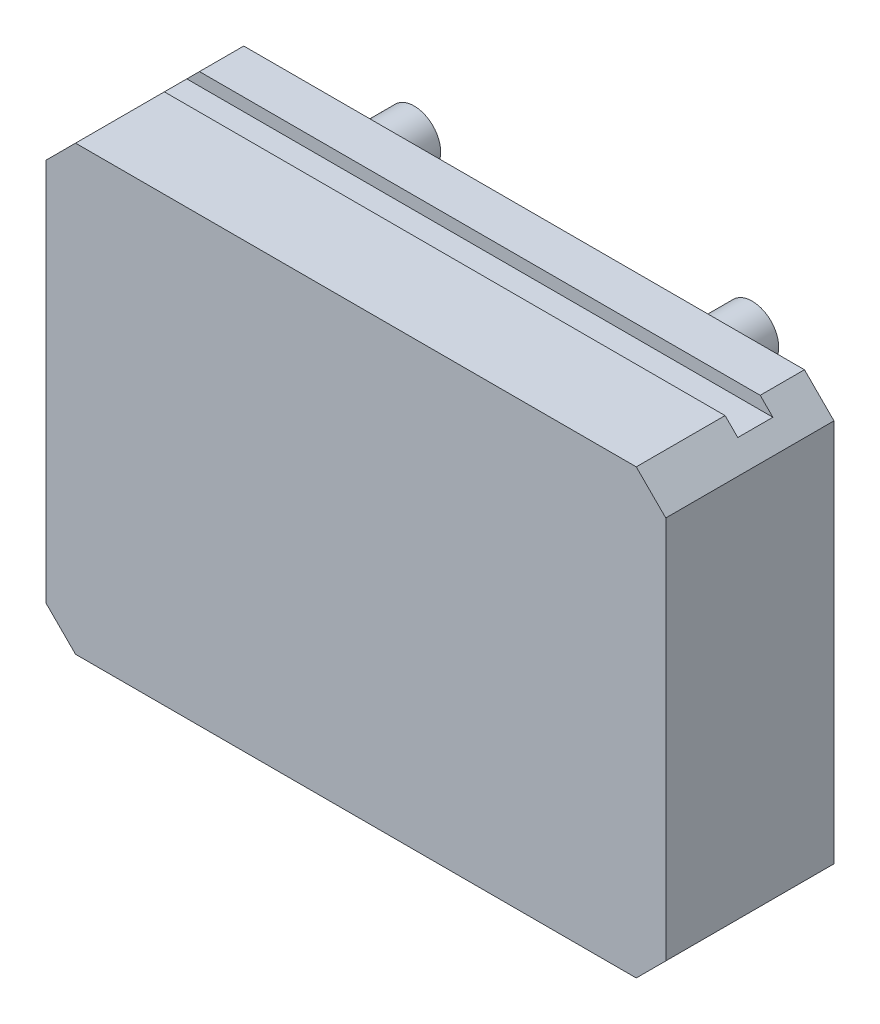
ISO-10303-21;
HEADER;
FILE_DESCRIPTION(('STEP AP214'),'2;1');
FILE_NAME('part.step','',(''),(''),'','','');
FILE_SCHEMA(('AUTOMOTIVE_DESIGN { 1 0 10303 214 1 1 1 1 }'));
ENDSEC;
DATA;
#1=APPLICATION_CONTEXT('core data for automotive mechanical design processes');
#2=APPLICATION_PROTOCOL_DEFINITION('international standard','automotive_design',2000,#1);
#3=PRODUCT_CONTEXT('',#1,'mechanical');
#4=PRODUCT('Part','Part','',(#3));
#5=PRODUCT_RELATED_PRODUCT_CATEGORY('part','',(#4));
#6=PRODUCT_DEFINITION_FORMATION('','',#4);
#7=PRODUCT_DEFINITION_CONTEXT('part definition',#1,'design');
#8=PRODUCT_DEFINITION('design','',#6,#7);
#9=PRODUCT_DEFINITION_SHAPE('','',#8);
#10=(LENGTH_UNIT() NAMED_UNIT(*) SI_UNIT(.MILLI.,.METRE.));
#11=(NAMED_UNIT(*) PLANE_ANGLE_UNIT() SI_UNIT($,.RADIAN.));
#12=(NAMED_UNIT(*) SI_UNIT($,.STERADIAN.) SOLID_ANGLE_UNIT());
#13=UNCERTAINTY_MEASURE_WITH_UNIT(LENGTH_MEASURE(1.E-05),#10,'distance_accuracy_value','');
#14=(GEOMETRIC_REPRESENTATION_CONTEXT(3) GLOBAL_UNCERTAINTY_ASSIGNED_CONTEXT((#13)) GLOBAL_UNIT_ASSIGNED_CONTEXT((#10,
#11,#12)) REPRESENTATION_CONTEXT('',''));
#15=CARTESIAN_POINT('',(0.,0.,0.));
#16=DIRECTION('',(0.,0.,1.));
#17=DIRECTION('',(1.,0.,0.));
#18=AXIS2_PLACEMENT_3D('',#15,#16,#17);
#19=CARTESIAN_POINT('',(-105.,-75.,57.));
#20=DIRECTION('',(1.,0.,0.));
#21=DIRECTION('',(0.,0.,-1.));
#22=AXIS2_PLACEMENT_3D('',#19,#20,#21);
#23=PLANE('',#22);
#24=DIRECTION('',(0.,-1.,0.));
#25=VECTOR('',#24,1.);
#26=CARTESIAN_POINT('',(-105.,-75.,57.));
#27=LINE('',#26,#25);
#28=CARTESIAN_POINT('',(-105.,64.9999999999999,57.));
#29=VERTEX_POINT('',#28);
#30=CARTESIAN_POINT('',(-105.,-64.9999999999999,57.));
#31=VERTEX_POINT('',#30);
#32=EDGE_CURVE('E264',#29,#31,#27,.T.);
#33=ORIENTED_EDGE('',*,*,#32,.F.);
#34=DIRECTION('',(0.,0.,-1.));
#35=VECTOR('',#34,1.);
#36=CARTESIAN_POINT('',(-105.,65.,57.));
#37=LINE('',#36,#35);
#38=CARTESIAN_POINT('',(-105.,64.9999999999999,0.));
#39=VERTEX_POINT('',#38);
#40=EDGE_CURVE('E206',#29,#39,#37,.T.);
#41=ORIENTED_EDGE('',*,*,#40,.T.);
#42=DIRECTION('',(0.,-1.,0.));
#43=VECTOR('',#42,1.);
#44=CARTESIAN_POINT('',(-105.,-75.,0.));
#45=LINE('',#44,#43);
#46=CARTESIAN_POINT('',(-105.,-64.9999999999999,0.));
#47=VERTEX_POINT('',#46);
#48=EDGE_CURVE('E274',#39,#47,#45,.T.);
#49=ORIENTED_EDGE('',*,*,#48,.T.);
#50=DIRECTION('',(0.,0.,1.));
#51=VECTOR('',#50,1.);
#52=CARTESIAN_POINT('',(-105.,-64.9999999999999,57.));
#53=LINE('',#52,#51);
#54=EDGE_CURVE('E204',#47,#31,#53,.T.);
#55=ORIENTED_EDGE('',*,*,#54,.T.);
#56=EDGE_LOOP('',(#33,#41,#49,#55));
#57=FACE_BOUND('',#56,.T.);
#58=CARTESIAN_POINT('',(-105.,0.,38.2));
#59=DIRECTION('',(1.,0.,0.));
#60=DIRECTION('',(0.,0.,-1.));
#61=AXIS2_PLACEMENT_3D('',#58,#59,#60);
#62=CIRCLE('',#61,7.5);
#63=CARTESIAN_POINT('',(-105.,0.,30.7));
#64=VERTEX_POINT('',#63);
#65=EDGE_CURVE('E11',#64,#64,#62,.F.);
#66=ORIENTED_EDGE('',*,*,#65,.F.);
#67=EDGE_LOOP('',(#66));
#68=FACE_BOUND('',#67,.T.);
#69=ADVANCED_FACE('F36',(#57,#68),#23,.F.);
#70=CARTESIAN_POINT('',(-105.,75.,57.));
#71=DIRECTION('',(0.,-1.,0.));
#72=DIRECTION('',(0.,0.,-1.));
#73=AXIS2_PLACEMENT_3D('',#70,#71,#72);
#74=PLANE('',#73);
#75=DIRECTION('',(1.,0.,0.));
#76=VECTOR('',#75,1.);
#77=CARTESIAN_POINT('',(-105.,75.,15.));
#78=LINE('',#77,#76);
#79=CARTESIAN_POINT('',(-95.,75.,15.));
#80=VERTEX_POINT('',#79);
#81=CARTESIAN_POINT('',(95.,75.,15.));
#82=VERTEX_POINT('',#81);
#83=EDGE_CURVE('E159',#80,#82,#78,.T.);
#84=ORIENTED_EDGE('',*,*,#83,.T.);
#85=DIRECTION('',(0.,0.,-1.));
#86=VECTOR('',#85,1.);
#87=CARTESIAN_POINT('',(95.,75.,57.));
#88=LINE('',#87,#86);
#89=CARTESIAN_POINT('',(95.,75.,0.));
#90=VERTEX_POINT('',#89);
#91=EDGE_CURVE('E178',#82,#90,#88,.T.);
#92=ORIENTED_EDGE('',*,*,#91,.T.);
#93=DIRECTION('',(-1.,0.,0.));
#94=VECTOR('',#93,1.);
#95=CARTESIAN_POINT('',(-105.,75.,0.));
#96=LINE('',#95,#94);
#97=CARTESIAN_POINT('',(-94.9999999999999,75.,0.));
#98=VERTEX_POINT('',#97);
#99=EDGE_CURVE('E256',#90,#98,#96,.T.);
#100=ORIENTED_EDGE('',*,*,#99,.T.);
#101=DIRECTION('',(0.,0.,1.));
#102=VECTOR('',#101,1.);
#103=CARTESIAN_POINT('',(-94.9999999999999,75.,57.));
#104=LINE('',#103,#102);
#105=EDGE_CURVE('E182',#98,#80,#104,.T.);
#106=ORIENTED_EDGE('',*,*,#105,.T.);
#107=EDGE_LOOP('',(#84,#92,#100,#106));
#108=FACE_BOUND('',#107,.T.);
#109=ADVANCED_FACE('F354',(#108),#74,.F.);
#110=DIRECTION('',(-1.,0.,0.));
#111=VECTOR('',#110,1.);
#112=CARTESIAN_POINT('',(-105.,75.,26.9));
#113=LINE('',#112,#111);
#114=CARTESIAN_POINT('',(95.,75.,26.9));
#115=VERTEX_POINT('',#114);
#116=CARTESIAN_POINT('',(-95.,75.,26.9));
#117=VERTEX_POINT('',#116);
#118=EDGE_CURVE('E148',#115,#117,#113,.T.);
#119=ORIENTED_EDGE('',*,*,#118,.T.);
#120=CARTESIAN_POINT('',(-94.9999999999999,75.,57.));
#121=VERTEX_POINT('',#120);
#122=EDGE_CURVE('E279',#117,#121,#104,.T.);
#123=ORIENTED_EDGE('',*,*,#122,.T.);
#124=DIRECTION('',(-1.,0.,0.));
#125=VECTOR('',#124,1.);
#126=CARTESIAN_POINT('',(-105.,75.,57.));
#127=LINE('',#126,#125);
#128=CARTESIAN_POINT('',(95.,75.,57.));
#129=VERTEX_POINT('',#128);
#130=EDGE_CURVE('E176',#129,#121,#127,.T.);
#131=ORIENTED_EDGE('',*,*,#130,.F.);
#132=EDGE_CURVE('E168',#129,#115,#88,.T.);
#133=ORIENTED_EDGE('',*,*,#132,.T.);
#134=EDGE_LOOP('',(#119,#123,#131,#133));
#135=FACE_BOUND('',#134,.T.);
#136=ADVANCED_FACE('F174',(#135),#74,.F.);
#137=CARTESIAN_POINT('',(95.,75.,57.));
#138=DIRECTION('',(-0.70710678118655,-0.707106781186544,0.));
#139=DIRECTION('',(0.707106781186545,-0.70710678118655,0.));
#140=AXIS2_PLACEMENT_3D('',#137,#138,#139);
#141=PLANE('',#140);
#142=ORIENTED_EDGE('',*,*,#91,.F.);
#143=DIRECTION('',(-0.707106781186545,0.707106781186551,0.));
#144=VECTOR('',#143,1.);
#145=CARTESIAN_POINT('',(95.,75.,15.));
#146=LINE('',#145,#144);
#147=CARTESIAN_POINT('',(99.3,70.7,15.));
#148=VERTEX_POINT('',#147);
#149=EDGE_CURVE('E171',#82,#148,#146,.F.);
#150=ORIENTED_EDGE('',*,*,#149,.T.);
#151=DIRECTION('',(0.,0.,1.));
#152=VECTOR('',#151,1.);
#153=CARTESIAN_POINT('',(99.3,70.7,57.));
#154=LINE('',#153,#152);
#155=CARTESIAN_POINT('',(99.3,70.7,26.9));
#156=VERTEX_POINT('',#155);
#157=EDGE_CURVE('E170',#156,#148,#154,.F.);
#158=ORIENTED_EDGE('',*,*,#157,.F.);
#159=DIRECTION('',(0.707106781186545,-0.707106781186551,0.));
#160=VECTOR('',#159,1.);
#161=CARTESIAN_POINT('',(95.,75.,26.9));
#162=LINE('',#161,#160);
#163=EDGE_CURVE('E152',#156,#115,#162,.F.);
#164=ORIENTED_EDGE('',*,*,#163,.T.);
#165=ORIENTED_EDGE('',*,*,#132,.F.);
#166=DIRECTION('',(0.707106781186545,-0.70710678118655,0.));
#167=VECTOR('',#166,1.);
#168=CARTESIAN_POINT('',(95.,75.,57.));
#169=LINE('',#168,#167);
#170=CARTESIAN_POINT('',(105.,64.9999999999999,57.));
#171=VERTEX_POINT('',#170);
#172=EDGE_CURVE('E202',#171,#129,#169,.F.);
#173=ORIENTED_EDGE('',*,*,#172,.F.);
#174=DIRECTION('',(0.,0.,1.));
#175=VECTOR('',#174,1.);
#176=CARTESIAN_POINT('',(105.,64.9999999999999,57.));
#177=LINE('',#176,#175);
#178=CARTESIAN_POINT('',(105.,64.9999999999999,0.));
#179=VERTEX_POINT('',#178);
#180=EDGE_CURVE('E194',#179,#171,#177,.T.);
#181=ORIENTED_EDGE('',*,*,#180,.F.);
#182=DIRECTION('',(-0.707106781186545,0.70710678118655,0.));
#183=VECTOR('',#182,1.);
#184=CARTESIAN_POINT('',(-4.99999999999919,175.,0.));
#185=LINE('',#184,#183);
#186=EDGE_CURVE('E189',#90,#179,#185,.F.);
#187=ORIENTED_EDGE('',*,*,#186,.F.);
#188=EDGE_LOOP('',(#142,#150,#158,#164,#165,#173,#181,#187));
#189=FACE_BOUND('',#188,.T.);
#190=ADVANCED_FACE('F166',(#189),#141,.F.);
#191=CARTESIAN_POINT('',(-105.,65.,57.));
#192=DIRECTION('',(0.707106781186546,-0.707106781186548,0.));
#193=DIRECTION('',(0.707106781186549,0.707106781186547,0.));
#194=AXIS2_PLACEMENT_3D('',#191,#192,#193);
#195=PLANE('',#194);
#196=DIRECTION('',(0.,0.,-1.));
#197=VECTOR('',#196,1.);
#198=CARTESIAN_POINT('',(-99.3,70.7,57.));
#199=LINE('',#198,#197);
#200=CARTESIAN_POINT('',(-99.3,70.7,15.));
#201=VERTEX_POINT('',#200);
#202=CARTESIAN_POINT('',(-99.3,70.7,26.9));
#203=VERTEX_POINT('',#202);
#204=EDGE_CURVE('E223',#201,#203,#199,.F.);
#205=ORIENTED_EDGE('',*,*,#204,.F.);
#206=DIRECTION('',(-0.707106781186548,-0.707106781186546,0.));
#207=VECTOR('',#206,1.);
#208=CARTESIAN_POINT('',(-105.,65.,15.));
#209=LINE('',#208,#207);
#210=EDGE_CURVE('E226',#201,#80,#209,.F.);
#211=ORIENTED_EDGE('',*,*,#210,.T.);
#212=ORIENTED_EDGE('',*,*,#105,.F.);
#213=DIRECTION('',(-0.707106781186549,-0.707106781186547,0.));
#214=VECTOR('',#213,1.);
#215=CARTESIAN_POINT('',(-100.,70.,0.));
#216=LINE('',#215,#214);
#217=EDGE_CURVE('E187',#39,#98,#216,.F.);
#218=ORIENTED_EDGE('',*,*,#217,.F.);
#219=ORIENTED_EDGE('',*,*,#40,.F.);
#220=DIRECTION('',(0.707106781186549,0.707106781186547,0.));
#221=VECTOR('',#220,1.);
#222=CARTESIAN_POINT('',(-105.,65.,57.));
#223=LINE('',#222,#221);
#224=EDGE_CURVE('E200',#121,#29,#223,.F.);
#225=ORIENTED_EDGE('',*,*,#224,.F.);
#226=ORIENTED_EDGE('',*,*,#122,.F.);
#227=DIRECTION('',(0.707106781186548,0.707106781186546,0.));
#228=VECTOR('',#227,1.);
#229=CARTESIAN_POINT('',(-105.,65.,26.9));
#230=LINE('',#229,#228);
#231=EDGE_CURVE('E155',#117,#203,#230,.F.);
#232=ORIENTED_EDGE('',*,*,#231,.T.);
#233=EDGE_LOOP('',(#205,#211,#212,#218,#219,#225,#226,#232));
#234=FACE_BOUND('',#233,.T.);
#235=ADVANCED_FACE('F368',(#234),#195,.F.);
#236=CARTESIAN_POINT('',(-105.,-75.,57.));
#237=DIRECTION('',(0.,1.,0.));
#238=DIRECTION('',(0.,0.,1.));
#239=AXIS2_PLACEMENT_3D('',#236,#237,#238);
#240=PLANE('',#239);
#241=DIRECTION('',(0.,0.,-1.));
#242=VECTOR('',#241,1.);
#243=CARTESIAN_POINT('',(-95.,-75.,57.));
#244=LINE('',#243,#242);
#245=CARTESIAN_POINT('',(-95.,-75.,57.));
#246=VERTEX_POINT('',#245);
#247=CARTESIAN_POINT('',(-95.,-75.,26.9));
#248=VERTEX_POINT('',#247);
#249=EDGE_CURVE('E210',#246,#248,#244,.T.);
#250=ORIENTED_EDGE('',*,*,#249,.T.);
#251=DIRECTION('',(-1.,0.,0.));
#252=VECTOR('',#251,1.);
#253=CARTESIAN_POINT('',(-105.,-75.,26.9));
#254=LINE('',#253,#252);
#255=CARTESIAN_POINT('',(94.9999999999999,-75.,26.9));
#256=VERTEX_POINT('',#255);
#257=EDGE_CURVE('E290',#256,#248,#254,.T.);
#258=ORIENTED_EDGE('',*,*,#257,.F.);
#259=DIRECTION('',(0.,0.,1.));
#260=VECTOR('',#259,1.);
#261=CARTESIAN_POINT('',(94.9999999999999,-75.,57.));
#262=LINE('',#261,#260);
#263=CARTESIAN_POINT('',(95.,-75.,57.));
#264=VERTEX_POINT('',#263);
#265=EDGE_CURVE('E213',#256,#264,#262,.T.);
#266=ORIENTED_EDGE('',*,*,#265,.T.);
#267=DIRECTION('',(1.,0.,0.));
#268=VECTOR('',#267,1.);
#269=CARTESIAN_POINT('',(-105.,-75.,57.));
#270=LINE('',#269,#268);
#271=EDGE_CURVE('E267',#246,#264,#270,.T.);
#272=ORIENTED_EDGE('',*,*,#271,.F.);
#273=EDGE_LOOP('',(#250,#258,#266,#272));
#274=FACE_BOUND('',#273,.T.);
#275=ADVANCED_FACE('F370',(#274),#240,.F.);
#276=CARTESIAN_POINT('',(94.9999999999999,-75.,0.));
#277=VERTEX_POINT('',#276);
#278=CARTESIAN_POINT('',(94.9999999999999,-75.,15.));
#279=VERTEX_POINT('',#278);
#280=EDGE_CURVE('E214',#277,#279,#262,.T.);
#281=ORIENTED_EDGE('',*,*,#280,.T.);
#282=DIRECTION('',(1.,0.,0.));
#283=VECTOR('',#282,1.);
#284=CARTESIAN_POINT('',(-105.,-75.,15.));
#285=LINE('',#284,#283);
#286=CARTESIAN_POINT('',(-95.,-75.,15.));
#287=VERTEX_POINT('',#286);
#288=EDGE_CURVE('E293',#287,#279,#285,.T.);
#289=ORIENTED_EDGE('',*,*,#288,.F.);
#290=CARTESIAN_POINT('',(-95.,-75.,0.));
#291=VERTEX_POINT('',#290);
#292=EDGE_CURVE('E209',#287,#291,#244,.T.);
#293=ORIENTED_EDGE('',*,*,#292,.T.);
#294=DIRECTION('',(1.,0.,0.));
#295=VECTOR('',#294,1.);
#296=CARTESIAN_POINT('',(-105.,-75.,0.));
#297=LINE('',#296,#295);
#298=EDGE_CURVE('E269',#291,#277,#297,.T.);
#299=ORIENTED_EDGE('',*,*,#298,.T.);
#300=EDGE_LOOP('',(#281,#289,#293,#299));
#301=FACE_BOUND('',#300,.T.);
#302=ADVANCED_FACE('F364',(#301),#240,.F.);
#303=CARTESIAN_POINT('',(105.,-75.,57.));
#304=DIRECTION('',(-1.,0.,0.));
#305=DIRECTION('',(0.,0.,1.));
#306=AXIS2_PLACEMENT_3D('',#303,#304,#305);
#307=PLANE('',#306);
#308=DIRECTION('',(0.,1.,0.));
#309=VECTOR('',#308,1.);
#310=CARTESIAN_POINT('',(105.,-75.,0.));
#311=LINE('',#310,#309);
#312=CARTESIAN_POINT('',(105.,-65.,0.));
#313=VERTEX_POINT('',#312);
#314=EDGE_CURVE('E265',#313,#179,#311,.T.);
#315=ORIENTED_EDGE('',*,*,#314,.T.);
#316=ORIENTED_EDGE('',*,*,#180,.T.);
#317=DIRECTION('',(0.,1.,0.));
#318=VECTOR('',#317,1.);
#319=CARTESIAN_POINT('',(105.,-75.,57.));
#320=LINE('',#319,#318);
#321=CARTESIAN_POINT('',(105.,-65.,57.));
#322=VERTEX_POINT('',#321);
#323=EDGE_CURVE('E280',#322,#171,#320,.T.);
#324=ORIENTED_EDGE('',*,*,#323,.F.);
#325=DIRECTION('',(0.,0.,-1.));
#326=VECTOR('',#325,1.);
#327=CARTESIAN_POINT('',(105.,-65.,57.));
#328=LINE('',#327,#326);
#329=EDGE_CURVE('E191',#322,#313,#328,.T.);
#330=ORIENTED_EDGE('',*,*,#329,.T.);
#331=EDGE_LOOP('',(#315,#316,#324,#330));
#332=FACE_BOUND('',#331,.T.);
#333=ADVANCED_FACE('F407',(#332),#307,.F.);
#334=CARTESIAN_POINT('',(-105.,75.,57.));
#335=DIRECTION('',(0.,0.,-1.));
#336=DIRECTION('',(-1.,0.,0.));
#337=AXIS2_PLACEMENT_3D('',#334,#335,#336);
#338=PLANE('',#337);
#339=ORIENTED_EDGE('',*,*,#323,.T.);
#340=ORIENTED_EDGE('',*,*,#172,.T.);
#341=ORIENTED_EDGE('',*,*,#130,.T.);
#342=ORIENTED_EDGE('',*,*,#224,.T.);
#343=ORIENTED_EDGE('',*,*,#32,.T.);
#344=DIRECTION('',(-0.707106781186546,0.707106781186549,0.));
#345=VECTOR('',#344,1.);
#346=CARTESIAN_POINT('',(-95.,-75.,57.));
#347=LINE('',#346,#345);
#348=EDGE_CURVE('E196',#31,#246,#347,.F.);
#349=ORIENTED_EDGE('',*,*,#348,.T.);
#350=ORIENTED_EDGE('',*,*,#271,.T.);
#351=DIRECTION('',(-0.707106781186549,-0.707106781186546,0.));
#352=VECTOR('',#351,1.);
#353=CARTESIAN_POINT('',(105.,-65.,57.));
#354=LINE('',#353,#352);
#355=EDGE_CURVE('E198',#264,#322,#354,.F.);
#356=ORIENTED_EDGE('',*,*,#355,.T.);
#357=EDGE_LOOP('',(#339,#340,#341,#342,#343,#349,#350,#356));
#358=FACE_BOUND('',#357,.T.);
#359=ADVANCED_FACE('F246',(#358),#338,.F.);
#360=CARTESIAN_POINT('',(-105.,75.,0.));
#361=DIRECTION('',(0.,0.,-1.));
#362=DIRECTION('',(-1.,0.,0.));
#363=AXIS2_PLACEMENT_3D('',#360,#361,#362);
#364=PLANE('',#363);
#365=CARTESIAN_POINT('',(57.2756492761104,57.2756492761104,0.));
#366=DIRECTION('',(0.,0.,-1.));
#367=DIRECTION('',(-1.,0.,0.));
#368=AXIS2_PLACEMENT_3D('',#365,#366,#367);
#369=CIRCLE('',#368,9.99999999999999);
#370=CARTESIAN_POINT('',(47.2756492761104,57.2756492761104,0.));
#371=VERTEX_POINT('',#370);
#372=EDGE_CURVE('E44',#371,#371,#369,.T.);
#373=ORIENTED_EDGE('',*,*,#372,.F.);
#374=EDGE_LOOP('',(#373));
#375=FACE_BOUND('',#374,.T.);
#376=CARTESIAN_POINT('',(-57.2756492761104,57.2756492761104,0.));
#377=DIRECTION('',(0.,0.,-1.));
#378=DIRECTION('',(-1.,0.,0.));
#379=AXIS2_PLACEMENT_3D('',#376,#377,#378);
#380=CIRCLE('',#379,9.99999999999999);
#381=CARTESIAN_POINT('',(-67.2756492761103,57.2756492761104,0.));
#382=VERTEX_POINT('',#381);
#383=EDGE_CURVE('E235',#382,#382,#380,.T.);
#384=ORIENTED_EDGE('',*,*,#383,.F.);
#385=EDGE_LOOP('',(#384));
#386=FACE_BOUND('',#385,.T.);
#387=CARTESIAN_POINT('',(-57.2756492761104,-57.2756492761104,0.));
#388=DIRECTION('',(0.,0.,-1.));
#389=DIRECTION('',(-1.,0.,0.));
#390=AXIS2_PLACEMENT_3D('',#387,#388,#389);
#391=CIRCLE('',#390,9.99999999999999);
#392=CARTESIAN_POINT('',(-67.2756492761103,-57.2756492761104,0.));
#393=VERTEX_POINT('',#392);
#394=EDGE_CURVE('E232',#393,#393,#391,.T.);
#395=ORIENTED_EDGE('',*,*,#394,.F.);
#396=EDGE_LOOP('',(#395));
#397=FACE_BOUND('',#396,.T.);
#398=CARTESIAN_POINT('',(57.2756492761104,-57.2756492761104,0.));
#399=DIRECTION('',(0.,0.,-1.));
#400=DIRECTION('',(-1.,0.,0.));
#401=AXIS2_PLACEMENT_3D('',#398,#399,#400);
#402=CIRCLE('',#401,9.99999999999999);
#403=CARTESIAN_POINT('',(47.2756492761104,-57.2756492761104,0.));
#404=VERTEX_POINT('',#403);
#405=EDGE_CURVE('E229',#404,#404,#402,.T.);
#406=ORIENTED_EDGE('',*,*,#405,.F.);
#407=EDGE_LOOP('',(#406));
#408=FACE_BOUND('',#407,.T.);
#409=ORIENTED_EDGE('',*,*,#99,.F.);
#410=ORIENTED_EDGE('',*,*,#186,.T.);
#411=ORIENTED_EDGE('',*,*,#314,.F.);
#412=DIRECTION('',(0.707106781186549,0.707106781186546,0.));
#413=VECTOR('',#412,1.);
#414=CARTESIAN_POINT('',(69.9999999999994,-100.,0.));
#415=LINE('',#414,#413);
#416=EDGE_CURVE('E180',#313,#277,#415,.F.);
#417=ORIENTED_EDGE('',*,*,#416,.T.);
#418=ORIENTED_EDGE('',*,*,#298,.F.);
#419=DIRECTION('',(0.707106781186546,-0.707106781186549,0.));
#420=VECTOR('',#419,1.);
#421=CARTESIAN_POINT('',(-175.,5.00000000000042,0.));
#422=LINE('',#421,#420);
#423=EDGE_CURVE('E177',#291,#47,#422,.F.);
#424=ORIENTED_EDGE('',*,*,#423,.T.);
#425=ORIENTED_EDGE('',*,*,#48,.F.);
#426=ORIENTED_EDGE('',*,*,#217,.T.);
#427=EDGE_LOOP('',(#409,#410,#411,#417,#418,#424,#425,#426));
#428=FACE_BOUND('',#427,.T.);
#429=ADVANCED_FACE('F242',(#375,#386,#397,#408,#428),#364,.T.);
#430=CARTESIAN_POINT('',(105.,-65.,57.));
#431=DIRECTION('',(-0.707106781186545,0.707106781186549,0.));
#432=DIRECTION('',(-0.707106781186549,-0.707106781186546,0.));
#433=AXIS2_PLACEMENT_3D('',#430,#431,#432);
#434=PLANE('',#433);
#435=DIRECTION('',(0.70710678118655,0.707106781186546,0.));
#436=VECTOR('',#435,1.);
#437=CARTESIAN_POINT('',(105.,-65.,26.9));
#438=LINE('',#437,#436);
#439=CARTESIAN_POINT('',(99.3,-70.7,26.9));
#440=VERTEX_POINT('',#439);
#441=EDGE_CURVE('E277',#440,#256,#438,.F.);
#442=ORIENTED_EDGE('',*,*,#441,.F.);
#443=DIRECTION('',(0.,0.,-1.));
#444=VECTOR('',#443,1.);
#445=CARTESIAN_POINT('',(99.2999999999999,-70.7,57.));
#446=LINE('',#445,#444);
#447=CARTESIAN_POINT('',(99.3,-70.7,15.));
#448=VERTEX_POINT('',#447);
#449=EDGE_CURVE('E288',#448,#440,#446,.F.);
#450=ORIENTED_EDGE('',*,*,#449,.F.);
#451=DIRECTION('',(-0.70710678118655,-0.707106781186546,0.));
#452=VECTOR('',#451,1.);
#453=CARTESIAN_POINT('',(105.,-65.,15.));
#454=LINE('',#453,#452);
#455=EDGE_CURVE('E286',#279,#448,#454,.F.);
#456=ORIENTED_EDGE('',*,*,#455,.F.);
#457=ORIENTED_EDGE('',*,*,#280,.F.);
#458=ORIENTED_EDGE('',*,*,#416,.F.);
#459=ORIENTED_EDGE('',*,*,#329,.F.);
#460=ORIENTED_EDGE('',*,*,#355,.F.);
#461=ORIENTED_EDGE('',*,*,#265,.F.);
#462=EDGE_LOOP('',(#442,#450,#456,#457,#458,#459,#460,#461));
#463=FACE_BOUND('',#462,.T.);
#464=ADVANCED_FACE('F245',(#463),#434,.F.);
#465=CARTESIAN_POINT('',(-95.,-75.,57.));
#466=DIRECTION('',(0.707106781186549,0.707106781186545,0.));
#467=DIRECTION('',(-0.707106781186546,0.707106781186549,0.));
#468=AXIS2_PLACEMENT_3D('',#465,#466,#467);
#469=PLANE('',#468);
#470=DIRECTION('',(0.707106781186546,-0.70710678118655,0.));
#471=VECTOR('',#470,1.);
#472=CARTESIAN_POINT('',(-95.,-75.,26.9));
#473=LINE('',#472,#471);
#474=CARTESIAN_POINT('',(-99.3,-70.7,26.9));
#475=VERTEX_POINT('',#474);
#476=EDGE_CURVE('E221',#248,#475,#473,.F.);
#477=ORIENTED_EDGE('',*,*,#476,.F.);
#478=ORIENTED_EDGE('',*,*,#249,.F.);
#479=ORIENTED_EDGE('',*,*,#348,.F.);
#480=ORIENTED_EDGE('',*,*,#54,.F.);
#481=ORIENTED_EDGE('',*,*,#423,.F.);
#482=ORIENTED_EDGE('',*,*,#292,.F.);
#483=DIRECTION('',(-0.707106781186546,0.70710678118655,0.));
#484=VECTOR('',#483,1.);
#485=CARTESIAN_POINT('',(-95.,-75.,15.));
#486=LINE('',#485,#484);
#487=CARTESIAN_POINT('',(-99.3,-70.7,15.));
#488=VERTEX_POINT('',#487);
#489=EDGE_CURVE('E219',#488,#287,#486,.F.);
#490=ORIENTED_EDGE('',*,*,#489,.F.);
#491=DIRECTION('',(0.,0.,1.));
#492=VECTOR('',#491,1.);
#493=CARTESIAN_POINT('',(-99.3,-70.7,57.));
#494=LINE('',#493,#492);
#495=EDGE_CURVE('E217',#475,#488,#494,.F.);
#496=ORIENTED_EDGE('',*,*,#495,.F.);
#497=EDGE_LOOP('',(#477,#478,#479,#480,#481,#482,#490,#496));
#498=FACE_BOUND('',#497,.T.);
#499=ADVANCED_FACE('F38',(#498),#469,.F.);
#500=CARTESIAN_POINT('',(-105.,-70.7,26.9));
#501=DIRECTION('',(0.,0.,1.));
#502=DIRECTION('',(1.,0.,0.));
#503=AXIS2_PLACEMENT_3D('',#500,#501,#502);
#504=PLANE('',#503);
#505=ORIENTED_EDGE('',*,*,#441,.T.);
#506=ORIENTED_EDGE('',*,*,#257,.T.);
#507=ORIENTED_EDGE('',*,*,#476,.T.);
#508=DIRECTION('',(-1.,0.,0.));
#509=VECTOR('',#508,1.);
#510=CARTESIAN_POINT('',(-105.,-70.7,26.9));
#511=LINE('',#510,#509);
#512=EDGE_CURVE('E59',#440,#475,#511,.T.);
#513=ORIENTED_EDGE('',*,*,#512,.F.);
#514=EDGE_LOOP('',(#505,#506,#507,#513));
#515=FACE_BOUND('',#514,.T.);
#516=ADVANCED_FACE('F377',(#515),#504,.F.);
#517=CARTESIAN_POINT('',(-105.,-70.7,15.));
#518=DIRECTION('',(0.,0.,-1.));
#519=DIRECTION('',(-1.,0.,0.));
#520=AXIS2_PLACEMENT_3D('',#517,#518,#519);
#521=PLANE('',#520);
#522=ORIENTED_EDGE('',*,*,#455,.T.);
#523=DIRECTION('',(1.,0.,0.));
#524=VECTOR('',#523,1.);
#525=CARTESIAN_POINT('',(-105.,-70.7,15.));
#526=LINE('',#525,#524);
#527=EDGE_CURVE('E292',#488,#448,#526,.T.);
#528=ORIENTED_EDGE('',*,*,#527,.F.);
#529=ORIENTED_EDGE('',*,*,#489,.T.);
#530=ORIENTED_EDGE('',*,*,#288,.T.);
#531=EDGE_LOOP('',(#522,#528,#529,#530));
#532=FACE_BOUND('',#531,.T.);
#533=ADVANCED_FACE('F398',(#532),#521,.F.);
#534=CARTESIAN_POINT('',(-105.,-70.7,26.9));
#535=DIRECTION('',(0.,1.,0.));
#536=DIRECTION('',(0.,0.,1.));
#537=AXIS2_PLACEMENT_3D('',#534,#535,#536);
#538=PLANE('',#537);
#539=ORIENTED_EDGE('',*,*,#449,.T.);
#540=ORIENTED_EDGE('',*,*,#512,.T.);
#541=ORIENTED_EDGE('',*,*,#495,.T.);
#542=ORIENTED_EDGE('',*,*,#527,.T.);
#543=EDGE_LOOP('',(#539,#540,#541,#542));
#544=FACE_BOUND('',#543,.T.);
#545=ADVANCED_FACE('F396',(#544),#538,.F.);
#546=CARTESIAN_POINT('',(-105.,70.7,15.));
#547=DIRECTION('',(0.,0.,1.));
#548=DIRECTION('',(1.,0.,0.));
#549=AXIS2_PLACEMENT_3D('',#546,#547,#548);
#550=PLANE('',#549);
#551=ORIENTED_EDGE('',*,*,#83,.F.);
#552=ORIENTED_EDGE('',*,*,#210,.F.);
#553=DIRECTION('',(1.,0.,0.));
#554=VECTOR('',#553,1.);
#555=CARTESIAN_POINT('',(-105.,70.7,15.));
#556=LINE('',#555,#554);
#557=EDGE_CURVE('E51',#201,#148,#556,.T.);
#558=ORIENTED_EDGE('',*,*,#557,.T.);
#559=ORIENTED_EDGE('',*,*,#149,.F.);
#560=EDGE_LOOP('',(#551,#552,#558,#559));
#561=FACE_BOUND('',#560,.T.);
#562=ADVANCED_FACE('F411',(#561),#550,.T.);
#563=CARTESIAN_POINT('',(-105.,70.7,26.9));
#564=DIRECTION('',(0.,0.,-1.));
#565=DIRECTION('',(-1.,0.,0.));
#566=AXIS2_PLACEMENT_3D('',#563,#564,#565);
#567=PLANE('',#566);
#568=DIRECTION('',(-1.,0.,0.));
#569=VECTOR('',#568,1.);
#570=CARTESIAN_POINT('',(-105.,70.7,26.9));
#571=LINE('',#570,#569);
#572=EDGE_CURVE('E301',#156,#203,#571,.T.);
#573=ORIENTED_EDGE('',*,*,#572,.T.);
#574=ORIENTED_EDGE('',*,*,#231,.F.);
#575=ORIENTED_EDGE('',*,*,#118,.F.);
#576=ORIENTED_EDGE('',*,*,#163,.F.);
#577=EDGE_LOOP('',(#573,#574,#575,#576));
#578=FACE_BOUND('',#577,.T.);
#579=ADVANCED_FACE('F151',(#578),#567,.T.);
#580=CARTESIAN_POINT('',(-105.,70.7,26.9));
#581=DIRECTION('',(0.,-1.,0.));
#582=DIRECTION('',(0.,0.,1.));
#583=AXIS2_PLACEMENT_3D('',#580,#581,#582);
#584=PLANE('',#583);
#585=ORIENTED_EDGE('',*,*,#157,.T.);
#586=ORIENTED_EDGE('',*,*,#557,.F.);
#587=ORIENTED_EDGE('',*,*,#204,.T.);
#588=ORIENTED_EDGE('',*,*,#572,.F.);
#589=EDGE_LOOP('',(#585,#586,#587,#588));
#590=FACE_BOUND('',#589,.T.);
#591=ADVANCED_FACE('F413',(#590),#584,.F.);
#592=CARTESIAN_POINT('',(57.2756492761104,-57.2756492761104,0.));
#593=DIRECTION('',(0.,0.,1.));
#594=DIRECTION('',(1.,0.,0.));
#595=AXIS2_PLACEMENT_3D('',#592,#593,#594);
#596=CYLINDRICAL_SURFACE('',#595,9.99999999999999);
#597=CARTESIAN_POINT('',(57.2756492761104,-57.2756492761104,-3.));
#598=DIRECTION('',(0.,0.,1.));
#599=DIRECTION('',(1.,0.,0.));
#600=AXIS2_PLACEMENT_3D('',#597,#598,#599);
#601=CIRCLE('',#600,9.99999999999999);
#602=CARTESIAN_POINT('',(67.2756492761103,-57.2756492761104,-3.));
#603=VERTEX_POINT('',#602);
#604=EDGE_CURVE('E160',#603,#603,#601,.T.);
#605=ORIENTED_EDGE('',*,*,#604,.T.);
#606=EDGE_LOOP('',(#605));
#607=FACE_BOUND('',#606,.T.);
#608=ORIENTED_EDGE('',*,*,#405,.T.);
#609=EDGE_LOOP('',(#608));
#610=FACE_BOUND('',#609,.T.);
#611=ADVANCED_FACE('F415',(#607,#610),#596,.T.);
#612=CARTESIAN_POINT('',(57.2756492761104,-57.2756492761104,-3.));
#613=DIRECTION('',(0.,0.,1.));
#614=DIRECTION('',(1.,0.,0.));
#615=AXIS2_PLACEMENT_3D('',#612,#613,#614);
#616=CONICAL_SURFACE('',#615,9.99999999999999,0.785398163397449);
#617=CARTESIAN_POINT('',(57.2756492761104,-57.2756492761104,-4.));
#618=DIRECTION('',(0.,0.,1.));
#619=DIRECTION('',(1.,0.,0.));
#620=AXIS2_PLACEMENT_3D('',#617,#618,#619);
#621=CIRCLE('',#620,8.99999999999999);
#622=CARTESIAN_POINT('',(66.2756492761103,-57.2756492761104,-4.));
#623=VERTEX_POINT('',#622);
#624=EDGE_CURVE('E307',#623,#623,#621,.T.);
#625=ORIENTED_EDGE('',*,*,#624,.T.);
#626=EDGE_LOOP('',(#625));
#627=FACE_BOUND('',#626,.T.);
#628=ORIENTED_EDGE('',*,*,#604,.F.);
#629=EDGE_LOOP('',(#628));
#630=FACE_BOUND('',#629,.T.);
#631=ADVANCED_FACE('F421',(#627,#630),#616,.T.);
#632=CARTESIAN_POINT('',(57.2756492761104,-57.2756492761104,0.));
#633=DIRECTION('',(0.,0.,1.));
#634=DIRECTION('',(1.,0.,0.));
#635=AXIS2_PLACEMENT_3D('',#632,#633,#634);
#636=CYLINDRICAL_SURFACE('',#635,8.99999999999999);
#637=CARTESIAN_POINT('',(57.2756492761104,-57.2756492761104,-20.));
#638=DIRECTION('',(0.,0.,1.));
#639=DIRECTION('',(1.,0.,0.));
#640=AXIS2_PLACEMENT_3D('',#637,#638,#639);
#641=CIRCLE('',#640,8.99999999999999);
#642=CARTESIAN_POINT('',(66.2756492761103,-57.2756492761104,-20.));
#643=VERTEX_POINT('',#642);
#644=EDGE_CURVE('E310',#643,#643,#641,.T.);
#645=ORIENTED_EDGE('',*,*,#644,.T.);
#646=EDGE_LOOP('',(#645));
#647=FACE_BOUND('',#646,.T.);
#648=ORIENTED_EDGE('',*,*,#624,.F.);
#649=EDGE_LOOP('',(#648));
#650=FACE_BOUND('',#649,.T.);
#651=ADVANCED_FACE('F584',(#647,#650),#636,.T.);
#652=CARTESIAN_POINT('',(57.2756492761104,-66.2756492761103,-20.));
#653=DIRECTION('',(0.,0.,-1.));
#654=DIRECTION('',(-1.,0.,0.));
#655=AXIS2_PLACEMENT_3D('',#652,#653,#654);
#656=PLANE('',#655);
#657=ORIENTED_EDGE('',*,*,#644,.F.);
#658=EDGE_LOOP('',(#657));
#659=FACE_BOUND('',#658,.T.);
#660=ADVANCED_FACE('F579',(#659),#656,.T.);
#661=CARTESIAN_POINT('',(-57.2756492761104,-57.2756492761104,0.));
#662=DIRECTION('',(0.,0.,1.));
#663=DIRECTION('',(-1.,0.,0.));
#664=AXIS2_PLACEMENT_3D('',#661,#662,#663);
#665=CYLINDRICAL_SURFACE('',#664,9.99999999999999);
#666=CARTESIAN_POINT('',(-57.2756492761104,-57.2756492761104,-3.));
#667=DIRECTION('',(0.,0.,-1.));
#668=DIRECTION('',(-1.,0.,0.));
#669=AXIS2_PLACEMENT_3D('',#666,#667,#668);
#670=CIRCLE('',#669,9.99999999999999);
#671=CARTESIAN_POINT('',(-67.2756492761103,-57.2756492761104,-3.));
#672=VERTEX_POINT('',#671);
#673=EDGE_CURVE('E313',#672,#672,#670,.T.);
#674=ORIENTED_EDGE('',*,*,#673,.F.);
#675=EDGE_LOOP('',(#674));
#676=FACE_BOUND('',#675,.T.);
#677=ORIENTED_EDGE('',*,*,#394,.T.);
#678=EDGE_LOOP('',(#677));
#679=FACE_BOUND('',#678,.T.);
#680=ADVANCED_FACE('F583',(#676,#679),#665,.T.);
#681=CARTESIAN_POINT('',(-57.2756492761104,-57.2756492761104,-3.));
#682=DIRECTION('',(0.,0.,1.));
#683=DIRECTION('',(-1.,0.,0.));
#684=AXIS2_PLACEMENT_3D('',#681,#682,#683);
#685=CONICAL_SURFACE('',#684,9.99999999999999,0.785398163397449);
#686=CARTESIAN_POINT('',(-57.2756492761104,-57.2756492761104,-4.));
#687=DIRECTION('',(0.,0.,-1.));
#688=DIRECTION('',(-1.,0.,0.));
#689=AXIS2_PLACEMENT_3D('',#686,#687,#688);
#690=CIRCLE('',#689,8.99999999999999);
#691=CARTESIAN_POINT('',(-66.2756492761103,-57.2756492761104,-4.));
#692=VERTEX_POINT('',#691);
#693=EDGE_CURVE('E316',#692,#692,#690,.T.);
#694=ORIENTED_EDGE('',*,*,#693,.F.);
#695=EDGE_LOOP('',(#694));
#696=FACE_BOUND('',#695,.T.);
#697=ORIENTED_EDGE('',*,*,#673,.T.);
#698=EDGE_LOOP('',(#697));
#699=FACE_BOUND('',#698,.T.);
#700=ADVANCED_FACE('F599',(#696,#699),#685,.T.);
#701=CARTESIAN_POINT('',(-57.2756492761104,-57.2756492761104,0.));
#702=DIRECTION('',(0.,0.,1.));
#703=DIRECTION('',(-1.,0.,0.));
#704=AXIS2_PLACEMENT_3D('',#701,#702,#703);
#705=CYLINDRICAL_SURFACE('',#704,8.99999999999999);
#706=CARTESIAN_POINT('',(-57.2756492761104,-57.2756492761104,-20.));
#707=DIRECTION('',(0.,0.,-1.));
#708=DIRECTION('',(-1.,0.,0.));
#709=AXIS2_PLACEMENT_3D('',#706,#707,#708);
#710=CIRCLE('',#709,8.99999999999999);
#711=CARTESIAN_POINT('',(-66.2756492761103,-57.2756492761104,-20.));
#712=VERTEX_POINT('',#711);
#713=EDGE_CURVE('E319',#712,#712,#710,.T.);
#714=ORIENTED_EDGE('',*,*,#713,.F.);
#715=EDGE_LOOP('',(#714));
#716=FACE_BOUND('',#715,.T.);
#717=ORIENTED_EDGE('',*,*,#693,.T.);
#718=EDGE_LOOP('',(#717));
#719=FACE_BOUND('',#718,.T.);
#720=ADVANCED_FACE('F607',(#716,#719),#705,.T.);
#721=CARTESIAN_POINT('',(-57.2756492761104,-66.2756492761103,-20.));
#722=DIRECTION('',(0.,0.,-1.));
#723=DIRECTION('',(1.,0.,0.));
#724=AXIS2_PLACEMENT_3D('',#721,#722,#723);
#725=PLANE('',#724);
#726=ORIENTED_EDGE('',*,*,#713,.T.);
#727=EDGE_LOOP('',(#726));
#728=FACE_BOUND('',#727,.T.);
#729=ADVANCED_FACE('F616',(#728),#725,.T.);
#730=CARTESIAN_POINT('',(-57.2756492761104,57.2756492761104,0.));
#731=DIRECTION('',(0.,0.,1.));
#732=DIRECTION('',(-1.,0.,0.));
#733=AXIS2_PLACEMENT_3D('',#730,#731,#732);
#734=CYLINDRICAL_SURFACE('',#733,9.99999999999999);
#735=CARTESIAN_POINT('',(-57.2756492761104,57.2756492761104,-3.));
#736=DIRECTION('',(0.,0.,1.));
#737=DIRECTION('',(-1.,0.,0.));
#738=AXIS2_PLACEMENT_3D('',#735,#736,#737);
#739=CIRCLE('',#738,9.99999999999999);
#740=CARTESIAN_POINT('',(-67.2756492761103,57.2756492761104,-3.));
#741=VERTEX_POINT('',#740);
#742=EDGE_CURVE('E322',#741,#741,#739,.T.);
#743=ORIENTED_EDGE('',*,*,#742,.T.);
#744=EDGE_LOOP('',(#743));
#745=FACE_BOUND('',#744,.T.);
#746=ORIENTED_EDGE('',*,*,#383,.T.);
#747=EDGE_LOOP('',(#746));
#748=FACE_BOUND('',#747,.T.);
#749=ADVANCED_FACE('F624',(#745,#748),#734,.T.);
#750=CARTESIAN_POINT('',(-57.2756492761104,57.2756492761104,-3.));
#751=DIRECTION('',(0.,0.,1.));
#752=DIRECTION('',(-1.,0.,0.));
#753=AXIS2_PLACEMENT_3D('',#750,#751,#752);
#754=CONICAL_SURFACE('',#753,9.99999999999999,0.785398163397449);
#755=CARTESIAN_POINT('',(-57.2756492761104,57.2756492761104,-4.));
#756=DIRECTION('',(0.,0.,1.));
#757=DIRECTION('',(-1.,0.,0.));
#758=AXIS2_PLACEMENT_3D('',#755,#756,#757);
#759=CIRCLE('',#758,8.99999999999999);
#760=CARTESIAN_POINT('',(-66.2756492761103,57.2756492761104,-4.));
#761=VERTEX_POINT('',#760);
#762=EDGE_CURVE('E325',#761,#761,#759,.T.);
#763=ORIENTED_EDGE('',*,*,#762,.T.);
#764=EDGE_LOOP('',(#763));
#765=FACE_BOUND('',#764,.T.);
#766=ORIENTED_EDGE('',*,*,#742,.F.);
#767=EDGE_LOOP('',(#766));
#768=FACE_BOUND('',#767,.T.);
#769=ADVANCED_FACE('F632',(#765,#768),#754,.T.);
#770=CARTESIAN_POINT('',(-57.2756492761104,57.2756492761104,0.));
#771=DIRECTION('',(0.,0.,1.));
#772=DIRECTION('',(-1.,0.,0.));
#773=AXIS2_PLACEMENT_3D('',#770,#771,#772);
#774=CYLINDRICAL_SURFACE('',#773,8.99999999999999);
#775=CARTESIAN_POINT('',(-57.2756492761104,57.2756492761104,-20.));
#776=DIRECTION('',(0.,0.,1.));
#777=DIRECTION('',(-1.,0.,0.));
#778=AXIS2_PLACEMENT_3D('',#775,#776,#777);
#779=CIRCLE('',#778,8.99999999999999);
#780=CARTESIAN_POINT('',(-66.2756492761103,57.2756492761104,-20.));
#781=VERTEX_POINT('',#780);
#782=EDGE_CURVE('E328',#781,#781,#779,.T.);
#783=ORIENTED_EDGE('',*,*,#782,.T.);
#784=EDGE_LOOP('',(#783));
#785=FACE_BOUND('',#784,.T.);
#786=ORIENTED_EDGE('',*,*,#762,.F.);
#787=EDGE_LOOP('',(#786));
#788=FACE_BOUND('',#787,.T.);
#789=ADVANCED_FACE('F640',(#785,#788),#774,.T.);
#790=CARTESIAN_POINT('',(-57.2756492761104,66.2756492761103,-20.));
#791=DIRECTION('',(0.,0.,-1.));
#792=DIRECTION('',(1.,0.,0.));
#793=AXIS2_PLACEMENT_3D('',#790,#791,#792);
#794=PLANE('',#793);
#795=ORIENTED_EDGE('',*,*,#782,.F.);
#796=EDGE_LOOP('',(#795));
#797=FACE_BOUND('',#796,.T.);
#798=ADVANCED_FACE('F647',(#797),#794,.T.);
#799=CARTESIAN_POINT('',(57.2756492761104,57.2756492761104,0.));
#800=DIRECTION('',(0.,0.,1.));
#801=DIRECTION('',(1.,0.,0.));
#802=AXIS2_PLACEMENT_3D('',#799,#800,#801);
#803=CYLINDRICAL_SURFACE('',#802,9.99999999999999);
#804=CARTESIAN_POINT('',(57.2756492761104,57.2756492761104,-3.));
#805=DIRECTION('',(0.,0.,-1.));
#806=DIRECTION('',(1.,0.,0.));
#807=AXIS2_PLACEMENT_3D('',#804,#805,#806);
#808=CIRCLE('',#807,9.99999999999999);
#809=CARTESIAN_POINT('',(67.2756492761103,57.2756492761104,-3.));
#810=VERTEX_POINT('',#809);
#811=EDGE_CURVE('E331',#810,#810,#808,.T.);
#812=ORIENTED_EDGE('',*,*,#811,.F.);
#813=EDGE_LOOP('',(#812));
#814=FACE_BOUND('',#813,.T.);
#815=ORIENTED_EDGE('',*,*,#372,.T.);
#816=EDGE_LOOP('',(#815));
#817=FACE_BOUND('',#816,.T.);
#818=ADVANCED_FACE('F240',(#814,#817),#803,.T.);
#819=CARTESIAN_POINT('',(57.2756492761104,57.2756492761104,-3.));
#820=DIRECTION('',(0.,0.,1.));
#821=DIRECTION('',(1.,0.,0.));
#822=AXIS2_PLACEMENT_3D('',#819,#820,#821);
#823=CONICAL_SURFACE('',#822,9.99999999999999,0.785398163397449);
#824=CARTESIAN_POINT('',(57.2756492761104,57.2756492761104,-4.));
#825=DIRECTION('',(0.,0.,-1.));
#826=DIRECTION('',(1.,0.,0.));
#827=AXIS2_PLACEMENT_3D('',#824,#825,#826);
#828=CIRCLE('',#827,8.99999999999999);
#829=CARTESIAN_POINT('',(66.2756492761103,57.2756492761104,-4.));
#830=VERTEX_POINT('',#829);
#831=EDGE_CURVE('E334',#830,#830,#828,.T.);
#832=ORIENTED_EDGE('',*,*,#831,.F.);
#833=EDGE_LOOP('',(#832));
#834=FACE_BOUND('',#833,.T.);
#835=ORIENTED_EDGE('',*,*,#811,.T.);
#836=EDGE_LOOP('',(#835));
#837=FACE_BOUND('',#836,.T.);
#838=ADVANCED_FACE('F661',(#834,#837),#823,.T.);
#839=CARTESIAN_POINT('',(57.2756492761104,57.2756492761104,0.));
#840=DIRECTION('',(0.,0.,1.));
#841=DIRECTION('',(1.,0.,0.));
#842=AXIS2_PLACEMENT_3D('',#839,#840,#841);
#843=CYLINDRICAL_SURFACE('',#842,8.99999999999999);
#844=CARTESIAN_POINT('',(57.2756492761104,57.2756492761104,-20.));
#845=DIRECTION('',(0.,0.,-1.));
#846=DIRECTION('',(1.,0.,0.));
#847=AXIS2_PLACEMENT_3D('',#844,#845,#846);
#848=CIRCLE('',#847,8.99999999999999);
#849=CARTESIAN_POINT('',(66.2756492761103,57.2756492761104,-20.));
#850=VERTEX_POINT('',#849);
#851=EDGE_CURVE('E337',#850,#850,#848,.T.);
#852=ORIENTED_EDGE('',*,*,#851,.F.);
#853=EDGE_LOOP('',(#852));
#854=FACE_BOUND('',#853,.T.);
#855=ORIENTED_EDGE('',*,*,#831,.T.);
#856=EDGE_LOOP('',(#855));
#857=FACE_BOUND('',#856,.T.);
#858=ADVANCED_FACE('F668',(#854,#857),#843,.T.);
#859=CARTESIAN_POINT('',(57.2756492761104,66.2756492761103,-20.));
#860=DIRECTION('',(0.,0.,-1.));
#861=DIRECTION('',(-1.,0.,0.));
#862=AXIS2_PLACEMENT_3D('',#859,#860,#861);
#863=PLANE('',#862);
#864=ORIENTED_EDGE('',*,*,#851,.T.);
#865=EDGE_LOOP('',(#864));
#866=FACE_BOUND('',#865,.T.);
#867=ADVANCED_FACE('F349',(#866),#863,.T.);
#868=CARTESIAN_POINT('',(-115.,0.,38.2));
#869=DIRECTION('',(1.,0.,0.));
#870=DIRECTION('',(0.,0.,-1.));
#871=AXIS2_PLACEMENT_3D('',#868,#869,#870);
#872=CYLINDRICAL_SURFACE('',#871,7.5);
#873=CARTESIAN_POINT('',(-115.,0.,38.2));
#874=DIRECTION('',(-1.,0.,0.));
#875=DIRECTION('',(0.,0.,1.));
#876=AXIS2_PLACEMENT_3D('',#873,#874,#875);
#877=CIRCLE('',#876,7.5);
#878=CARTESIAN_POINT('',(-115.,0.,45.7));
#879=VERTEX_POINT('',#878);
#880=EDGE_CURVE('E340',#879,#879,#877,.T.);
#881=ORIENTED_EDGE('',*,*,#880,.F.);
#882=EDGE_LOOP('',(#881));
#883=FACE_BOUND('',#882,.T.);
#884=ORIENTED_EDGE('',*,*,#65,.T.);
#885=EDGE_LOOP('',(#884));
#886=FACE_BOUND('',#885,.T.);
#887=ADVANCED_FACE('F346',(#883,#886),#872,.T.);
#888=CARTESIAN_POINT('',(-115.,0.,38.2));
#889=DIRECTION('',(-1.,0.,0.));
#890=DIRECTION('',(0.,0.,1.));
#891=AXIS2_PLACEMENT_3D('',#888,#889,#890);
#892=PLANE('',#891);
#893=ORIENTED_EDGE('',*,*,#880,.T.);
#894=EDGE_LOOP('',(#893));
#895=FACE_BOUND('',#894,.T.);
#896=ADVANCED_FACE('F344',(#895),#892,.T.);
#897=CLOSED_SHELL('',(#69,#109,#136,#190,#235,#275,#302,#333,#359,#429,#464,#499,#516,#533,#545,
#562,#579,#591,#611,#631,#651,#660,#680,#700,#720,#729,#749,#769,#789,#798,#818,#838,#858,#867,
#887,#896));
#898=MANIFOLD_SOLID_BREP('B2',#897);
#899=ADVANCED_BREP_SHAPE_REPRESENTATION('',(#18,#898),#14);
#900=SHAPE_DEFINITION_REPRESENTATION(#9,#899);
ENDSEC;
END-ISO-10303-21;
